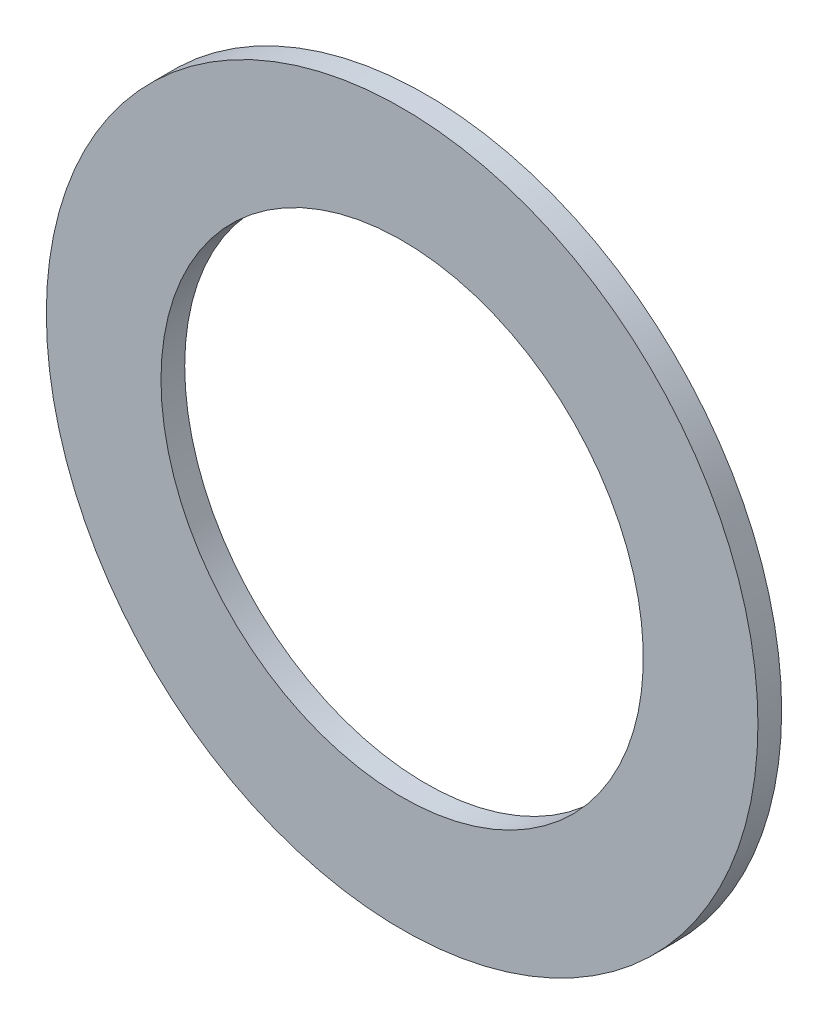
ISO-10303-21;
HEADER;
FILE_DESCRIPTION(('STEP AP214'),'2;1');
FILE_NAME('part.step','',(''),(''),'','','');
FILE_SCHEMA(('AUTOMOTIVE_DESIGN { 1 0 10303 214 1 1 1 1 }'));
ENDSEC;
DATA;
#1=APPLICATION_CONTEXT('core data for automotive mechanical design processes');
#2=APPLICATION_PROTOCOL_DEFINITION('international standard','automotive_design',2000,#1);
#3=PRODUCT_CONTEXT('',#1,'mechanical');
#4=PRODUCT('Part','Part','',(#3));
#5=PRODUCT_RELATED_PRODUCT_CATEGORY('part','',(#4));
#6=PRODUCT_DEFINITION_FORMATION('','',#4);
#7=PRODUCT_DEFINITION_CONTEXT('part definition',#1,'design');
#8=PRODUCT_DEFINITION('design','',#6,#7);
#9=PRODUCT_DEFINITION_SHAPE('','',#8);
#10=(LENGTH_UNIT() NAMED_UNIT(*) SI_UNIT(.MILLI.,.METRE.));
#11=(NAMED_UNIT(*) PLANE_ANGLE_UNIT() SI_UNIT($,.RADIAN.));
#12=(NAMED_UNIT(*) SI_UNIT($,.STERADIAN.) SOLID_ANGLE_UNIT());
#13=UNCERTAINTY_MEASURE_WITH_UNIT(LENGTH_MEASURE(1.E-05),#10,'distance_accuracy_value','');
#14=(GEOMETRIC_REPRESENTATION_CONTEXT(3) GLOBAL_UNCERTAINTY_ASSIGNED_CONTEXT((#13)) GLOBAL_UNIT_ASSIGNED_CONTEXT((#10,
#11,#12)) REPRESENTATION_CONTEXT('',''));
#15=CARTESIAN_POINT('',(0.,0.,0.));
#16=DIRECTION('',(0.,0.,1.));
#17=DIRECTION('',(1.,0.,0.));
#18=AXIS2_PLACEMENT_3D('',#15,#16,#17);
#19=CARTESIAN_POINT('',(-2.22044604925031E-13,0.,0.599999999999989));
#20=DIRECTION('',(0.,0.,1.));
#21=DIRECTION('',(1.,0.,0.));
#22=AXIS2_PLACEMENT_3D('',#19,#20,#21);
#23=PLANE('',#22);
#24=CARTESIAN_POINT('',(-2.22044604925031E-13,0.,0.599999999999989));
#25=DIRECTION('',(0.,0.,1.));
#26=DIRECTION('',(1.,0.,0.));
#27=AXIS2_PLACEMENT_3D('',#24,#25,#26);
#28=CIRCLE('',#27,9.);
#29=CARTESIAN_POINT('',(-9.00000000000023,0.,0.59999999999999));
#30=VERTEX_POINT('',#29);
#31=EDGE_CURVE('E10',#30,#30,#28,.T.);
#32=ORIENTED_EDGE('',*,*,#31,.T.);
#33=EDGE_LOOP('',(#32));
#34=FACE_BOUND('',#33,.T.);
#35=CARTESIAN_POINT('',(-2.22044604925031E-13,0.,0.599999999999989));
#36=DIRECTION('',(0.,0.,1.));
#37=DIRECTION('',(1.,0.,0.));
#38=AXIS2_PLACEMENT_3D('',#35,#36,#37);
#39=CIRCLE('',#38,6.1);
#40=CARTESIAN_POINT('',(-6.10000000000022,0.,0.599999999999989));
#41=VERTEX_POINT('',#40);
#42=EDGE_CURVE('E39',#41,#41,#39,.T.);
#43=ORIENTED_EDGE('',*,*,#42,.F.);
#44=EDGE_LOOP('',(#43));
#45=FACE_BOUND('',#44,.T.);
#46=ADVANCED_FACE('F28',(#34,#45),#23,.T.);
#47=CARTESIAN_POINT('',(0.,0.,0.));
#48=DIRECTION('',(0.,0.,1.));
#49=DIRECTION('',(1.,0.,0.));
#50=AXIS2_PLACEMENT_3D('',#47,#48,#49);
#51=PLANE('',#50);
#52=CARTESIAN_POINT('',(0.,0.,0.));
#53=DIRECTION('',(0.,0.,1.));
#54=DIRECTION('',(1.,0.,0.));
#55=AXIS2_PLACEMENT_3D('',#52,#53,#54);
#56=CIRCLE('',#55,9.);
#57=CARTESIAN_POINT('',(-9.00000000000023,0.,0.));
#58=VERTEX_POINT('',#57);
#59=EDGE_CURVE('E35',#58,#58,#56,.T.);
#60=ORIENTED_EDGE('',*,*,#59,.F.);
#61=EDGE_LOOP('',(#60));
#62=FACE_BOUND('',#61,.T.);
#63=CARTESIAN_POINT('',(0.,0.,0.));
#64=DIRECTION('',(0.,0.,1.));
#65=DIRECTION('',(1.,0.,0.));
#66=AXIS2_PLACEMENT_3D('',#63,#64,#65);
#67=CIRCLE('',#66,6.1);
#68=CARTESIAN_POINT('',(-6.10000000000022,0.,0.));
#69=VERTEX_POINT('',#68);
#70=EDGE_CURVE('E43',#69,#69,#67,.T.);
#71=ORIENTED_EDGE('',*,*,#70,.T.);
#72=EDGE_LOOP('',(#71));
#73=FACE_BOUND('',#72,.T.);
#74=ADVANCED_FACE('F49',(#62,#73),#51,.F.);
#75=CARTESIAN_POINT('',(-2.22044604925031E-13,0.,0.599999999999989));
#76=DIRECTION('',(0.,0.,-1.));
#77=DIRECTION('',(-1.,0.,0.));
#78=AXIS2_PLACEMENT_3D('',#75,#76,#77);
#79=CYLINDRICAL_SURFACE('',#78,9.);
#80=CARTESIAN_POINT('',(-9.00000000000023,0.,0.59999999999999));
#81=CARTESIAN_POINT('',(-9.00000000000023,0.,0.59374999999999));
#82=CARTESIAN_POINT('',(-9.00000000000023,0.,0.58749999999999));
#83=CARTESIAN_POINT('',(-9.00000000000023,0.,0.57499999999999));
#84=CARTESIAN_POINT('',(-9.00000000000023,0.,0.56874999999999));
#85=CARTESIAN_POINT('',(-9.00000000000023,0.,0.55624999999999));
#86=CARTESIAN_POINT('',(-9.00000000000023,0.,0.54999999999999));
#87=CARTESIAN_POINT('',(-9.00000000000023,0.,0.537499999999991));
#88=CARTESIAN_POINT('',(-9.00000000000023,0.,0.531249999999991));
#89=CARTESIAN_POINT('',(-9.00000000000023,0.,0.518749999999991));
#90=CARTESIAN_POINT('',(-9.00000000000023,0.,0.512499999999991));
#91=CARTESIAN_POINT('',(-9.00000000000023,0.,0.499999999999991));
#92=CARTESIAN_POINT('',(-9.00000000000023,0.,0.493749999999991));
#93=CARTESIAN_POINT('',(-9.00000000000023,0.,0.481249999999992));
#94=CARTESIAN_POINT('',(-9.00000000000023,0.,0.474999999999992));
#95=CARTESIAN_POINT('',(-9.00000000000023,0.,0.462499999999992));
#96=CARTESIAN_POINT('',(-9.00000000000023,0.,0.456249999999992));
#97=CARTESIAN_POINT('',(-9.00000000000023,0.,0.443749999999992));
#98=CARTESIAN_POINT('',(-9.00000000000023,0.,0.437499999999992));
#99=CARTESIAN_POINT('',(-9.00000000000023,0.,0.424999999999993));
#100=CARTESIAN_POINT('',(-9.00000000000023,0.,0.418749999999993));
#101=CARTESIAN_POINT('',(-9.00000000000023,0.,0.406249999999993));
#102=CARTESIAN_POINT('',(-9.00000000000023,0.,0.399999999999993));
#103=CARTESIAN_POINT('',(-9.00000000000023,0.,0.387499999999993));
#104=CARTESIAN_POINT('',(-9.00000000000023,0.,0.381249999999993));
#105=CARTESIAN_POINT('',(-9.00000000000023,0.,0.368749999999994));
#106=CARTESIAN_POINT('',(-9.00000000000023,0.,0.362499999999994));
#107=CARTESIAN_POINT('',(-9.00000000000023,0.,0.349999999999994));
#108=CARTESIAN_POINT('',(-9.00000000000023,0.,0.343749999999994));
#109=CARTESIAN_POINT('',(-9.00000000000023,0.,0.331249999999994));
#110=CARTESIAN_POINT('',(-9.00000000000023,0.,0.324999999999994));
#111=CARTESIAN_POINT('',(-9.00000000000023,0.,0.312499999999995));
#112=CARTESIAN_POINT('',(-9.00000000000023,0.,0.306249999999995));
#113=CARTESIAN_POINT('',(-9.00000000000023,0.,0.293749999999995));
#114=CARTESIAN_POINT('',(-9.00000000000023,0.,0.287499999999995));
#115=CARTESIAN_POINT('',(-9.00000000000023,0.,0.274999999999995));
#116=CARTESIAN_POINT('',(-9.00000000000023,0.,0.268749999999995));
#117=CARTESIAN_POINT('',(-9.00000000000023,0.,0.256249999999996));
#118=CARTESIAN_POINT('',(-9.00000000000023,0.,0.249999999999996));
#119=CARTESIAN_POINT('',(-9.00000000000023,0.,0.237499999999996));
#120=CARTESIAN_POINT('',(-9.00000000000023,0.,0.231249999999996));
#121=CARTESIAN_POINT('',(-9.00000000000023,0.,0.218749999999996));
#122=CARTESIAN_POINT('',(-9.00000000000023,0.,0.212499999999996));
#123=CARTESIAN_POINT('',(-9.00000000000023,0.,0.199999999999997));
#124=CARTESIAN_POINT('',(-9.00000000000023,0.,0.193749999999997));
#125=CARTESIAN_POINT('',(-9.00000000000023,0.,0.181249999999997));
#126=CARTESIAN_POINT('',(-9.00000000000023,0.,0.174999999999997));
#127=CARTESIAN_POINT('',(-9.00000000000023,0.,0.162499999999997));
#128=CARTESIAN_POINT('',(-9.00000000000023,0.,0.156249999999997));
#129=CARTESIAN_POINT('',(-9.00000000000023,0.,0.143749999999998));
#130=CARTESIAN_POINT('',(-9.00000000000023,0.,0.137499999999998));
#131=CARTESIAN_POINT('',(-9.00000000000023,0.,0.124999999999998));
#132=CARTESIAN_POINT('',(-9.00000000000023,0.,0.118749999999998));
#133=CARTESIAN_POINT('',(-9.00000000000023,0.,0.106249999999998));
#134=CARTESIAN_POINT('',(-9.00000000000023,0.,0.0999999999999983));
#135=CARTESIAN_POINT('',(-9.00000000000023,0.,0.0874999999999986));
#136=CARTESIAN_POINT('',(-9.00000000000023,0.,0.0812499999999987));
#137=CARTESIAN_POINT('',(-9.00000000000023,0.,0.0687499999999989));
#138=CARTESIAN_POINT('',(-9.00000000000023,0.,0.062499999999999));
#139=CARTESIAN_POINT('',(-9.00000000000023,0.,0.0499999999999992));
#140=CARTESIAN_POINT('',(-9.00000000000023,0.,0.0437499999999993));
#141=CARTESIAN_POINT('',(-9.00000000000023,0.,0.0312499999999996));
#142=CARTESIAN_POINT('',(-9.00000000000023,0.,0.0249999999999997));
#143=CARTESIAN_POINT('',(-9.00000000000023,0.,0.0124999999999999));
#144=CARTESIAN_POINT('',(-9.00000000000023,0.,0.00625));
#145=CARTESIAN_POINT('',(-9.00000000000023,0.,0.));
#146=B_SPLINE_CURVE_WITH_KNOTS('',3,(#80,#81,#82,#83,#84,#85,#86,#87,#88,#89,#90,#91,#92,#93,
#94,#95,#96,#97,#98,#99,#100,#101,#102,#103,#104,#105,#106,#107,#108,#109,#110,#111,#112,#113,
#114,#115,#116,#117,#118,#119,#120,#121,#122,#123,#124,#125,#126,#127,#128,#129,#130,#131,#132,
#133,#134,#135,#136,#137,#138,#139,#140,#141,#142,#143,#144,#145),.UNSPECIFIED.,.F.,.F.,(4,2,2,
2,2,2,2,2,2,2,2,2,2,2,2,2,2,2,2,2,2,2,2,2,2,2,2,2,2,2,2,2,4),(0.,0.0187499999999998,
0.0374999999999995,0.0562499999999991,0.0749999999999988,0.0937499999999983,0.112499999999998,
0.131249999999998,0.149999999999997,0.168749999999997,0.187499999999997,0.206249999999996,
0.224999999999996,0.243749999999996,0.262499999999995,0.281249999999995,0.299999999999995,
0.318749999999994,0.337499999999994,0.356249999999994,0.374999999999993,0.393749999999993,
0.412499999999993,0.431249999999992,0.449999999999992,0.468749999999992,0.487499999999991,
0.506249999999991,0.524999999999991,0.54374999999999,0.56249999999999,0.58124999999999,
0.599999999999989),.UNSPECIFIED.);
#147=EDGE_CURVE('BSEAM30',#30,#58,#146,.T.);
#148=ORIENTED_EDGE('',*,*,#31,.F.);
#149=ORIENTED_EDGE('',*,*,#59,.T.);
#150=ORIENTED_EDGE('',*,*,#147,.T.);
#151=ORIENTED_EDGE('',*,*,#147,.F.);
#152=EDGE_LOOP('',(#148,#150,#149,#151));
#153=FACE_BOUND('',#152,.T.);
#154=ADVANCED_FACE('F30',(#153),#79,.T.);
#155=CARTESIAN_POINT('',(-2.22044604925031E-13,0.,0.599999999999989));
#156=DIRECTION('',(0.,0.,-1.));
#157=DIRECTION('',(-1.,0.,0.));
#158=AXIS2_PLACEMENT_3D('',#155,#156,#157);
#159=CYLINDRICAL_SURFACE('',#158,6.1);
#160=CARTESIAN_POINT('',(-6.10000000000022,0.,0.599999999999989));
#161=CARTESIAN_POINT('',(-6.10000000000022,0.,0.59374999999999));
#162=CARTESIAN_POINT('',(-6.10000000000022,0.,0.58749999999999));
#163=CARTESIAN_POINT('',(-6.10000000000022,0.,0.57499999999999));
#164=CARTESIAN_POINT('',(-6.10000000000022,0.,0.56874999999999));
#165=CARTESIAN_POINT('',(-6.10000000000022,0.,0.55624999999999));
#166=CARTESIAN_POINT('',(-6.10000000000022,0.,0.54999999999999));
#167=CARTESIAN_POINT('',(-6.10000000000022,0.,0.537499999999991));
#168=CARTESIAN_POINT('',(-6.10000000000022,0.,0.531249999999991));
#169=CARTESIAN_POINT('',(-6.10000000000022,0.,0.518749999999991));
#170=CARTESIAN_POINT('',(-6.10000000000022,0.,0.512499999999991));
#171=CARTESIAN_POINT('',(-6.10000000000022,0.,0.499999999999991));
#172=CARTESIAN_POINT('',(-6.10000000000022,0.,0.493749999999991));
#173=CARTESIAN_POINT('',(-6.10000000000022,0.,0.481249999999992));
#174=CARTESIAN_POINT('',(-6.10000000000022,0.,0.474999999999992));
#175=CARTESIAN_POINT('',(-6.10000000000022,0.,0.462499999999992));
#176=CARTESIAN_POINT('',(-6.10000000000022,0.,0.456249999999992));
#177=CARTESIAN_POINT('',(-6.10000000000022,0.,0.443749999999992));
#178=CARTESIAN_POINT('',(-6.10000000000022,0.,0.437499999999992));
#179=CARTESIAN_POINT('',(-6.10000000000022,0.,0.424999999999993));
#180=CARTESIAN_POINT('',(-6.10000000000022,0.,0.418749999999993));
#181=CARTESIAN_POINT('',(-6.10000000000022,0.,0.406249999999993));
#182=CARTESIAN_POINT('',(-6.10000000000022,0.,0.399999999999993));
#183=CARTESIAN_POINT('',(-6.10000000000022,0.,0.387499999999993));
#184=CARTESIAN_POINT('',(-6.10000000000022,0.,0.381249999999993));
#185=CARTESIAN_POINT('',(-6.10000000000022,0.,0.368749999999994));
#186=CARTESIAN_POINT('',(-6.10000000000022,0.,0.362499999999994));
#187=CARTESIAN_POINT('',(-6.10000000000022,0.,0.349999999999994));
#188=CARTESIAN_POINT('',(-6.10000000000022,0.,0.343749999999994));
#189=CARTESIAN_POINT('',(-6.10000000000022,0.,0.331249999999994));
#190=CARTESIAN_POINT('',(-6.10000000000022,0.,0.324999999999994));
#191=CARTESIAN_POINT('',(-6.10000000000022,0.,0.312499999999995));
#192=CARTESIAN_POINT('',(-6.10000000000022,0.,0.306249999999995));
#193=CARTESIAN_POINT('',(-6.10000000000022,0.,0.293749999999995));
#194=CARTESIAN_POINT('',(-6.10000000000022,0.,0.287499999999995));
#195=CARTESIAN_POINT('',(-6.10000000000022,0.,0.274999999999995));
#196=CARTESIAN_POINT('',(-6.10000000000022,0.,0.268749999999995));
#197=CARTESIAN_POINT('',(-6.10000000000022,0.,0.256249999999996));
#198=CARTESIAN_POINT('',(-6.10000000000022,0.,0.249999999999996));
#199=CARTESIAN_POINT('',(-6.10000000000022,0.,0.237499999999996));
#200=CARTESIAN_POINT('',(-6.10000000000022,0.,0.231249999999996));
#201=CARTESIAN_POINT('',(-6.10000000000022,0.,0.218749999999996));
#202=CARTESIAN_POINT('',(-6.10000000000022,0.,0.212499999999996));
#203=CARTESIAN_POINT('',(-6.10000000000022,0.,0.199999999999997));
#204=CARTESIAN_POINT('',(-6.10000000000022,0.,0.193749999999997));
#205=CARTESIAN_POINT('',(-6.10000000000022,0.,0.181249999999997));
#206=CARTESIAN_POINT('',(-6.10000000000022,0.,0.174999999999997));
#207=CARTESIAN_POINT('',(-6.10000000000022,0.,0.162499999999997));
#208=CARTESIAN_POINT('',(-6.10000000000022,0.,0.156249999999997));
#209=CARTESIAN_POINT('',(-6.10000000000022,0.,0.143749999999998));
#210=CARTESIAN_POINT('',(-6.10000000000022,0.,0.137499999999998));
#211=CARTESIAN_POINT('',(-6.10000000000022,0.,0.124999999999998));
#212=CARTESIAN_POINT('',(-6.10000000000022,0.,0.118749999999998));
#213=CARTESIAN_POINT('',(-6.10000000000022,0.,0.106249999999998));
#214=CARTESIAN_POINT('',(-6.10000000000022,0.,0.0999999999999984));
#215=CARTESIAN_POINT('',(-6.10000000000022,0.,0.0874999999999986));
#216=CARTESIAN_POINT('',(-6.10000000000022,0.,0.0812499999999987));
#217=CARTESIAN_POINT('',(-6.10000000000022,0.,0.0687499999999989));
#218=CARTESIAN_POINT('',(-6.10000000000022,0.,0.062499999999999));
#219=CARTESIAN_POINT('',(-6.10000000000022,0.,0.0499999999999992));
#220=CARTESIAN_POINT('',(-6.10000000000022,0.,0.0437499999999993));
#221=CARTESIAN_POINT('',(-6.10000000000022,0.,0.0312499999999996));
#222=CARTESIAN_POINT('',(-6.10000000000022,0.,0.0249999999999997));
#223=CARTESIAN_POINT('',(-6.10000000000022,0.,0.0124999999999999));
#224=CARTESIAN_POINT('',(-6.10000000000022,0.,0.00625));
#225=CARTESIAN_POINT('',(-6.10000000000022,0.,0.));
#226=B_SPLINE_CURVE_WITH_KNOTS('',3,(#160,#161,#162,#163,#164,#165,#166,#167,#168,#169,#170,
#171,#172,#173,#174,#175,#176,#177,#178,#179,#180,#181,#182,#183,#184,#185,#186,#187,#188,#189,
#190,#191,#192,#193,#194,#195,#196,#197,#198,#199,#200,#201,#202,#203,#204,#205,#206,#207,#208,
#209,#210,#211,#212,#213,#214,#215,#216,#217,#218,#219,#220,#221,#222,#223,#224,#225),
.UNSPECIFIED.,.F.,.F.,(4,2,2,2,2,2,2,2,2,2,2,2,2,2,2,2,2,2,2,2,2,2,2,2,2,2,2,2,2,2,2,2,4),(0.,
0.0187499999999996,0.0374999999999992,0.0562499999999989,0.0749999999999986,0.0937499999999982,
0.112499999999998,0.131249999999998,0.149999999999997,0.168749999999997,0.187499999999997,
0.206249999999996,0.224999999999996,0.243749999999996,0.262499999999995,0.281249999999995,
0.299999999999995,0.318749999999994,0.337499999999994,0.356249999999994,0.374999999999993,
0.393749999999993,0.412499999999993,0.431249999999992,0.449999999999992,0.468749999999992,
0.487499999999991,0.506249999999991,0.524999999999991,0.54374999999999,0.56249999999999,
0.58124999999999,0.599999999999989),.UNSPECIFIED.);
#227=EDGE_CURVE('BSEAM51',#41,#69,#226,.T.);
#228=ORIENTED_EDGE('',*,*,#42,.T.);
#229=ORIENTED_EDGE('',*,*,#70,.F.);
#230=ORIENTED_EDGE('',*,*,#227,.T.);
#231=ORIENTED_EDGE('',*,*,#227,.F.);
#232=EDGE_LOOP('',(#228,#230,#229,#231));
#233=FACE_BOUND('',#232,.T.);
#234=ADVANCED_FACE('F51',(#233),#159,.F.);
#235=CLOSED_SHELL('',(#46,#74,#154,#234));
#236=MANIFOLD_SOLID_BREP('B2',#235);
#237=ADVANCED_BREP_SHAPE_REPRESENTATION('',(#18,#236),#14);
#238=SHAPE_DEFINITION_REPRESENTATION(#9,#237);
ENDSEC;
END-ISO-10303-21;
